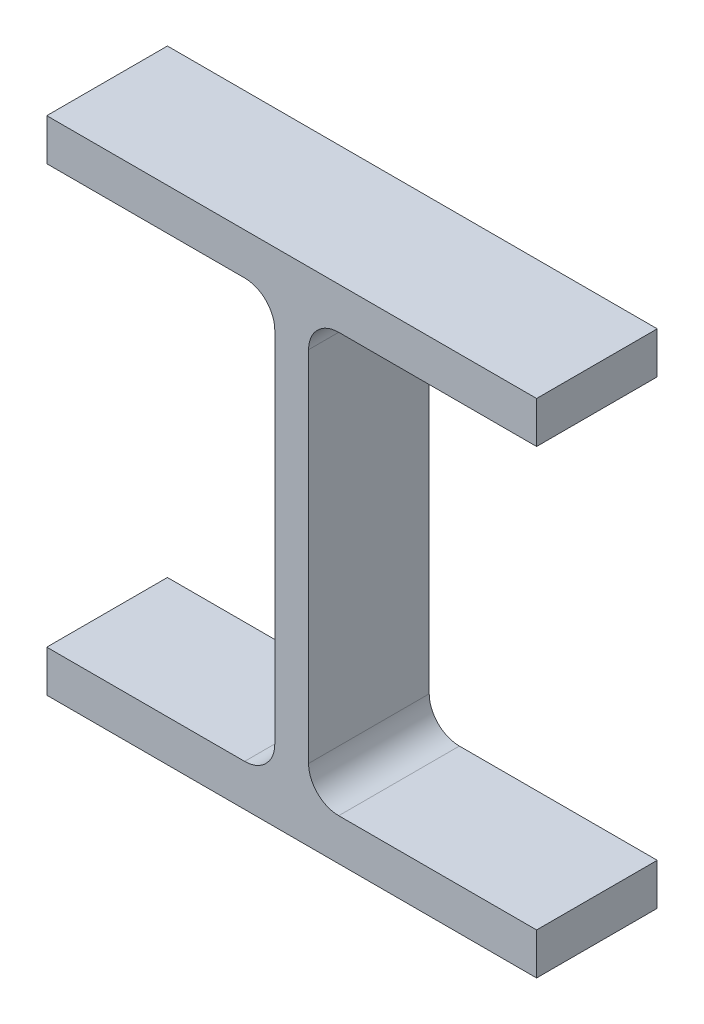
from build123d import *

# Parameters (mm, degrees)
BASESTEELW_DEPTH = 12.7


with BuildPart() as part:
    # Sketch1 → BaseSteelW (new, symmetric)
    with BuildSketch(Plane.XY):
        with BuildLine():
            Line((0, 0), (0, 8.76299241))
            Line((0, 8.76299241), (41.65596392, 8.76299241))
            ThreePointArc((41.65596392, 8.76299241), (46.146088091, 10.622862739), (48.00595842, 15.11298691))
            Line((48.00595842, 15.11298691), (48.00595842, 90.55092157))
            ThreePointArc((48.00595842, 90.55092157), (46.146088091, 95.041045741), (41.65596392, 96.90091607))
            Line((41.65596392, 96.90091607), (0, 96.90091607))
            Line((0, 96.90091607), (0, 105.66390848))
            Line((0, 105.66390848), (103.12391068, 105.66390848))
            Line((103.12391068, 105.66390848), (103.12391068, 96.90091607))
            Line((103.12391068, 96.90091607), (61.46794676, 96.90091607))
            ThreePointArc((61.46794676, 96.90091607), (56.977822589, 95.041045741), (55.11795226, 90.55092157))
            Line((55.11795226, 90.55092157), (55.11795226, 15.11298691))
            ThreePointArc((55.11795226, 15.11298691), (56.977822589, 10.622862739), (61.46794676, 8.76299241))
            Line((61.46794676, 8.76299241), (103.12391068, 8.76299241))
            Line((103.12391068, 8.76299241), (103.12391068, 0))
            Line((103.12391068, 0), (0, 0))
        make_face()
    extrude(amount=BASESTEELW_DEPTH, both=True)


solid = part.part
